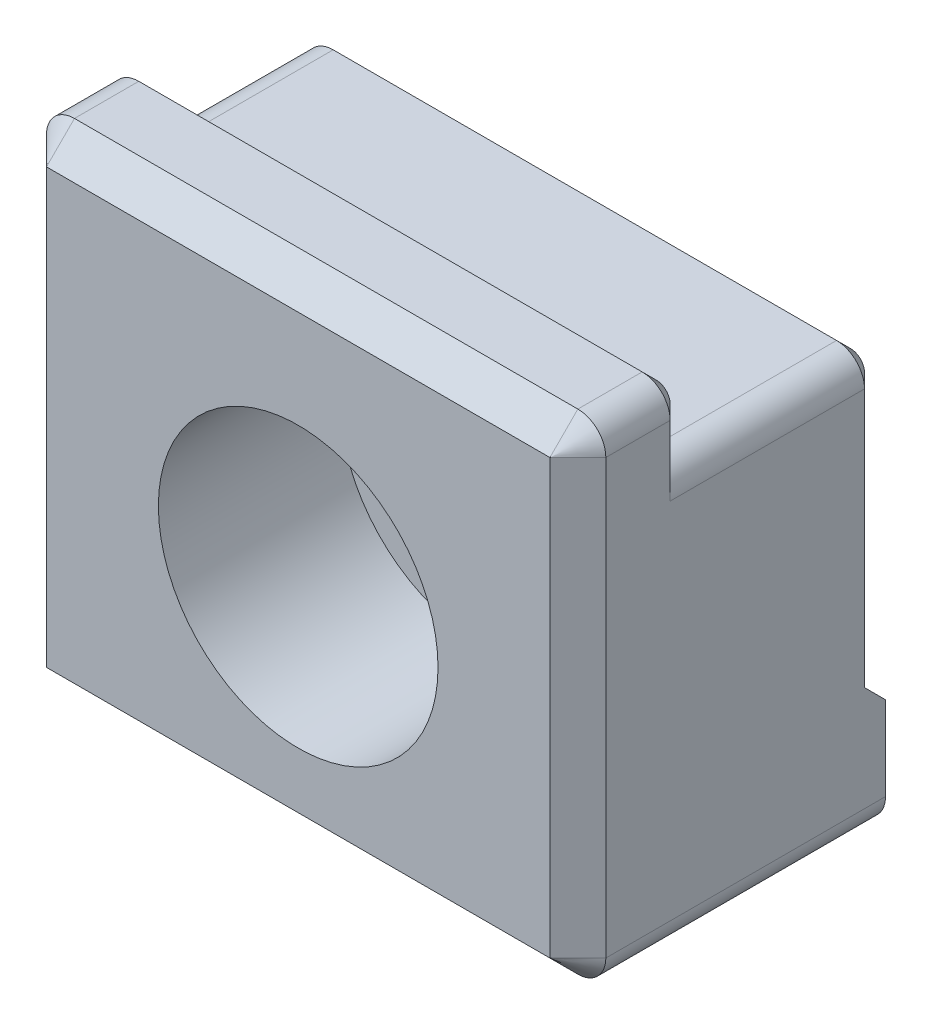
ISO-10303-21;
HEADER;
FILE_DESCRIPTION(('STEP AP214'),'2;1');
FILE_NAME('part.step','',(''),(''),'','','');
FILE_SCHEMA(('AUTOMOTIVE_DESIGN { 1 0 10303 214 1 1 1 1 }'));
ENDSEC;
DATA;
#1=APPLICATION_CONTEXT('core data for automotive mechanical design processes');
#2=APPLICATION_PROTOCOL_DEFINITION('international standard','automotive_design',2000,#1);
#3=PRODUCT_CONTEXT('',#1,'mechanical');
#4=PRODUCT('Part','Part','',(#3));
#5=PRODUCT_RELATED_PRODUCT_CATEGORY('part','',(#4));
#6=PRODUCT_DEFINITION_FORMATION('','',#4);
#7=PRODUCT_DEFINITION_CONTEXT('part definition',#1,'design');
#8=PRODUCT_DEFINITION('design','',#6,#7);
#9=PRODUCT_DEFINITION_SHAPE('','',#8);
#10=(LENGTH_UNIT() NAMED_UNIT(*) SI_UNIT(.MILLI.,.METRE.));
#11=(NAMED_UNIT(*) PLANE_ANGLE_UNIT() SI_UNIT($,.RADIAN.));
#12=(NAMED_UNIT(*) SI_UNIT($,.STERADIAN.) SOLID_ANGLE_UNIT());
#13=UNCERTAINTY_MEASURE_WITH_UNIT(LENGTH_MEASURE(1.E-05),#10,'distance_accuracy_value','');
#14=(GEOMETRIC_REPRESENTATION_CONTEXT(3) GLOBAL_UNCERTAINTY_ASSIGNED_CONTEXT((#13)) GLOBAL_UNIT_ASSIGNED_CONTEXT((#10,
#11,#12)) REPRESENTATION_CONTEXT('',''));
#15=CARTESIAN_POINT('',(0.,0.,0.));
#16=DIRECTION('',(0.,0.,1.));
#17=DIRECTION('',(1.,0.,0.));
#18=AXIS2_PLACEMENT_3D('',#15,#16,#17);
#19=CARTESIAN_POINT('',(-20.,-16.,23.));
#20=DIRECTION('',(0.,1.,0.));
#21=DIRECTION('',(0.,0.,-1.));
#22=AXIS2_PLACEMENT_3D('',#19,#20,#21);
#23=PLANE('',#22);
#24=DIRECTION('',(0.,0.,1.));
#25=VECTOR('',#24,1.);
#26=CARTESIAN_POINT('',(-18.,-16.,23.));
#27=LINE('',#26,#25);
#28=CARTESIAN_POINT('',(-18.,-16.,21.));
#29=VERTEX_POINT('',#28);
#30=CARTESIAN_POINT('',(-18.,-16.,1.));
#31=VERTEX_POINT('',#30);
#32=EDGE_CURVE('E208',#29,#31,#27,.F.);
#33=ORIENTED_EDGE('',*,*,#32,.T.);
#34=DIRECTION('',(1.,0.,0.));
#35=VECTOR('',#34,1.);
#36=CARTESIAN_POINT('',(-20.,-16.,1.));
#37=LINE('',#36,#35);
#38=CARTESIAN_POINT('',(18.,-16.,1.));
#39=VERTEX_POINT('',#38);
#40=EDGE_CURVE('E281',#31,#39,#37,.T.);
#41=ORIENTED_EDGE('',*,*,#40,.T.);
#42=DIRECTION('',(0.,0.,1.));
#43=VECTOR('',#42,1.);
#44=CARTESIAN_POINT('',(18.,-16.,23.));
#45=LINE('',#44,#43);
#46=CARTESIAN_POINT('',(18.,-16.,21.));
#47=VERTEX_POINT('',#46);
#48=EDGE_CURVE('E213',#39,#47,#45,.T.);
#49=ORIENTED_EDGE('',*,*,#48,.T.);
#50=DIRECTION('',(-1.,0.,0.));
#51=VECTOR('',#50,1.);
#52=CARTESIAN_POINT('',(-20.,-16.,21.));
#53=LINE('',#52,#51);
#54=EDGE_CURVE('E230',#47,#29,#53,.T.);
#55=ORIENTED_EDGE('',*,*,#54,.T.);
#56=EDGE_LOOP('',(#33,#41,#49,#55));
#57=FACE_BOUND('',#56,.T.);
#58=ADVANCED_FACE('F14',(#57),#23,.F.);
#59=CARTESIAN_POINT('',(-20.,19.,23.));
#60=DIRECTION('',(0.,0.,-1.));
#61=DIRECTION('',(1.,0.,0.));
#62=AXIS2_PLACEMENT_3D('',#59,#60,#61);
#63=PLANE('',#62);
#64=DIRECTION('',(0.,1.,0.));
#65=VECTOR('',#64,1.);
#66=CARTESIAN_POINT('',(18.,17.,23.));
#67=LINE('',#66,#65);
#68=CARTESIAN_POINT('',(18.,-14.,23.));
#69=VERTEX_POINT('',#68);
#70=CARTESIAN_POINT('',(18.,17.,23.));
#71=VERTEX_POINT('',#70);
#72=EDGE_CURVE('E223',#69,#71,#67,.T.);
#73=ORIENTED_EDGE('',*,*,#72,.T.);
#74=DIRECTION('',(-1.,0.,0.));
#75=VECTOR('',#74,1.);
#76=CARTESIAN_POINT('',(-20.,17.,23.));
#77=LINE('',#76,#75);
#78=CARTESIAN_POINT('',(-18.,17.,23.));
#79=VERTEX_POINT('',#78);
#80=EDGE_CURVE('E225',#71,#79,#77,.T.);
#81=ORIENTED_EDGE('',*,*,#80,.T.);
#82=DIRECTION('',(0.,-1.,0.));
#83=VECTOR('',#82,1.);
#84=CARTESIAN_POINT('',(-18.,19.,23.));
#85=LINE('',#84,#83);
#86=CARTESIAN_POINT('',(-18.,-14.,23.));
#87=VERTEX_POINT('',#86);
#88=EDGE_CURVE('E219',#79,#87,#85,.T.);
#89=ORIENTED_EDGE('',*,*,#88,.T.);
#90=DIRECTION('',(1.,0.,0.));
#91=VECTOR('',#90,1.);
#92=CARTESIAN_POINT('',(-20.,-14.,23.));
#93=LINE('',#92,#91);
#94=EDGE_CURVE('E221',#87,#69,#93,.T.);
#95=ORIENTED_EDGE('',*,*,#94,.T.);
#96=EDGE_LOOP('',(#73,#81,#89,#95));
#97=FACE_BOUND('',#96,.T.);
#98=CARTESIAN_POINT('',(0.,0.,23.));
#99=DIRECTION('',(0.,0.,1.));
#100=DIRECTION('',(-1.,0.,0.));
#101=AXIS2_PLACEMENT_3D('',#98,#99,#100);
#102=CIRCLE('',#101,10.);
#103=CARTESIAN_POINT('',(-10.,0.,23.));
#104=VERTEX_POINT('',#103);
#105=EDGE_CURVE('E403',#104,#104,#102,.T.);
#106=ORIENTED_EDGE('',*,*,#105,.F.);
#107=EDGE_LOOP('',(#106));
#108=FACE_BOUND('',#107,.T.);
#109=ADVANCED_FACE('F458',(#97,#108),#63,.F.);
#110=CARTESIAN_POINT('',(-20.,19.,15.4));
#111=DIRECTION('',(0.,-1.,0.));
#112=DIRECTION('',(0.,0.,1.));
#113=AXIS2_PLACEMENT_3D('',#110,#111,#112);
#114=PLANE('',#113);
#115=DIRECTION('',(0.,0.,-1.));
#116=VECTOR('',#115,1.);
#117=CARTESIAN_POINT('',(18.,19.,15.4));
#118=LINE('',#117,#116);
#119=CARTESIAN_POINT('',(18.,19.,21.));
#120=VERTEX_POINT('',#119);
#121=CARTESIAN_POINT('',(18.,19.,16.4));
#122=VERTEX_POINT('',#121);
#123=EDGE_CURVE('E430',#120,#122,#118,.T.);
#124=ORIENTED_EDGE('',*,*,#123,.T.);
#125=DIRECTION('',(-1.,0.,0.));
#126=VECTOR('',#125,1.);
#127=CARTESIAN_POINT('',(-20.,19.,16.4));
#128=LINE('',#127,#126);
#129=CARTESIAN_POINT('',(-18.,19.,16.4));
#130=VERTEX_POINT('',#129);
#131=EDGE_CURVE('E35',#122,#130,#128,.T.);
#132=ORIENTED_EDGE('',*,*,#131,.T.);
#133=DIRECTION('',(0.,0.,-1.));
#134=VECTOR('',#133,1.);
#135=CARTESIAN_POINT('',(-18.,19.,15.4));
#136=LINE('',#135,#134);
#137=CARTESIAN_POINT('',(-18.,19.,21.));
#138=VERTEX_POINT('',#137);
#139=EDGE_CURVE('E432',#130,#138,#136,.F.);
#140=ORIENTED_EDGE('',*,*,#139,.T.);
#141=DIRECTION('',(1.,0.,0.));
#142=VECTOR('',#141,1.);
#143=CARTESIAN_POINT('',(-20.,19.,21.));
#144=LINE('',#143,#142);
#145=EDGE_CURVE('E210',#138,#120,#144,.T.);
#146=ORIENTED_EDGE('',*,*,#145,.T.);
#147=EDGE_LOOP('',(#124,#132,#140,#146));
#148=FACE_BOUND('',#147,.T.);
#149=ADVANCED_FACE('F551',(#148),#114,.F.);
#150=CARTESIAN_POINT('',(-20.,14.,15.4));
#151=DIRECTION('',(0.,0.,1.));
#152=DIRECTION('',(-1.,0.,0.));
#153=AXIS2_PLACEMENT_3D('',#150,#151,#152);
#154=PLANE('',#153);
#155=CARTESIAN_POINT('',(18.,17.,15.4));
#156=DIRECTION('',(0.,0.,1.));
#157=DIRECTION('',(-1.,0.,0.));
#158=AXIS2_PLACEMENT_3D('',#155,#156,#157);
#159=CIRCLE('',#158,1.);
#160=CARTESIAN_POINT('',(18.,18.,15.4));
#161=VERTEX_POINT('',#160);
#162=CARTESIAN_POINT('',(19.,17.,15.4));
#163=VERTEX_POINT('',#162);
#164=EDGE_CURVE('E299',#161,#163,#159,.F.);
#165=ORIENTED_EDGE('',*,*,#164,.T.);
#166=DIRECTION('',(0.,-1.,0.));
#167=VECTOR('',#166,1.);
#168=CARTESIAN_POINT('',(19.,12.,15.4));
#169=LINE('',#168,#167);
#170=CARTESIAN_POINT('',(19.,13.7320508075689,15.4));
#171=VERTEX_POINT('',#170);
#172=EDGE_CURVE('E305',#163,#171,#169,.T.);
#173=ORIENTED_EDGE('',*,*,#172,.T.);
#174=CARTESIAN_POINT('',(18.,12.,15.4));
#175=DIRECTION('',(0.,0.,1.));
#176=DIRECTION('',(-1.,0.,0.));
#177=AXIS2_PLACEMENT_3D('',#174,#175,#176);
#178=CIRCLE('',#177,2.);
#179=CARTESIAN_POINT('',(18.,14.,15.4));
#180=VERTEX_POINT('',#179);
#181=EDGE_CURVE('E202',#171,#180,#178,.T.);
#182=ORIENTED_EDGE('',*,*,#181,.T.);
#183=DIRECTION('',(1.,0.,0.));
#184=VECTOR('',#183,1.);
#185=CARTESIAN_POINT('',(-20.,14.,15.4));
#186=LINE('',#185,#184);
#187=CARTESIAN_POINT('',(-18.,14.,15.4));
#188=VERTEX_POINT('',#187);
#189=EDGE_CURVE('E185',#188,#180,#186,.T.);
#190=ORIENTED_EDGE('',*,*,#189,.F.);
#191=CARTESIAN_POINT('',(-18.,12.,15.4));
#192=DIRECTION('',(0.,0.,1.));
#193=DIRECTION('',(-1.,0.,0.));
#194=AXIS2_PLACEMENT_3D('',#191,#192,#193);
#195=CIRCLE('',#194,2.);
#196=CARTESIAN_POINT('',(-19.,13.7320508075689,15.4));
#197=VERTEX_POINT('',#196);
#198=EDGE_CURVE('E198',#188,#197,#195,.T.);
#199=ORIENTED_EDGE('',*,*,#198,.T.);
#200=DIRECTION('',(0.,1.,0.));
#201=VECTOR('',#200,1.);
#202=CARTESIAN_POINT('',(-19.,14.,15.4));
#203=LINE('',#202,#201);
#204=CARTESIAN_POINT('',(-19.,17.,15.4));
#205=VERTEX_POINT('',#204);
#206=EDGE_CURVE('E303',#197,#205,#203,.T.);
#207=ORIENTED_EDGE('',*,*,#206,.T.);
#208=CARTESIAN_POINT('',(-18.,17.,15.4));
#209=DIRECTION('',(0.,0.,1.));
#210=DIRECTION('',(-1.,0.,0.));
#211=AXIS2_PLACEMENT_3D('',#208,#209,#210);
#212=CIRCLE('',#211,1.);
#213=CARTESIAN_POINT('',(-18.,18.,15.4));
#214=VERTEX_POINT('',#213);
#215=EDGE_CURVE('E301',#205,#214,#212,.F.);
#216=ORIENTED_EDGE('',*,*,#215,.T.);
#217=DIRECTION('',(1.,0.,0.));
#218=VECTOR('',#217,1.);
#219=CARTESIAN_POINT('',(-20.,18.,15.4));
#220=LINE('',#219,#218);
#221=EDGE_CURVE('E297',#214,#161,#220,.T.);
#222=ORIENTED_EDGE('',*,*,#221,.T.);
#223=EDGE_LOOP('',(#165,#173,#182,#190,#199,#207,#216,#222));
#224=FACE_BOUND('',#223,.T.);
#225=ADVANCED_FACE('F197',(#224),#154,.F.);
#226=CARTESIAN_POINT('',(-20.,14.,1.5));
#227=DIRECTION('',(0.,-1.,0.));
#228=DIRECTION('',(0.,0.,1.));
#229=AXIS2_PLACEMENT_3D('',#226,#227,#228);
#230=PLANE('',#229);
#231=DIRECTION('',(0.,0.,-1.));
#232=VECTOR('',#231,1.);
#233=CARTESIAN_POINT('',(18.,14.,1.5));
#234=LINE('',#233,#232);
#235=CARTESIAN_POINT('',(18.,14.,2.5));
#236=VERTEX_POINT('',#235);
#237=EDGE_CURVE('E193',#180,#236,#234,.T.);
#238=ORIENTED_EDGE('',*,*,#237,.T.);
#239=DIRECTION('',(-1.,0.,0.));
#240=VECTOR('',#239,1.);
#241=CARTESIAN_POINT('',(-20.,14.,2.5));
#242=LINE('',#241,#240);
#243=CARTESIAN_POINT('',(-18.,14.,2.5));
#244=VERTEX_POINT('',#243);
#245=EDGE_CURVE('E188',#236,#244,#242,.T.);
#246=ORIENTED_EDGE('',*,*,#245,.T.);
#247=DIRECTION('',(0.,0.,-1.));
#248=VECTOR('',#247,1.);
#249=CARTESIAN_POINT('',(-18.,14.,1.5));
#250=LINE('',#249,#248);
#251=EDGE_CURVE('E181',#244,#188,#250,.F.);
#252=ORIENTED_EDGE('',*,*,#251,.T.);
#253=ORIENTED_EDGE('',*,*,#189,.T.);
#254=EDGE_LOOP('',(#238,#246,#252,#253));
#255=FACE_BOUND('',#254,.T.);
#256=ADVANCED_FACE('F184',(#255),#230,.F.);
#257=CARTESIAN_POINT('',(-20.,-7.5,1.5));
#258=DIRECTION('',(0.,0.,1.));
#259=DIRECTION('',(-1.,0.,0.));
#260=AXIS2_PLACEMENT_3D('',#257,#258,#259);
#261=PLANE('',#260);
#262=CARTESIAN_POINT('',(0.,0.,1.5));
#263=DIRECTION('',(0.,0.,1.));
#264=DIRECTION('',(-1.,0.,0.));
#265=AXIS2_PLACEMENT_3D('',#262,#263,#264);
#266=CIRCLE('',#265,6.75);
#267=CARTESIAN_POINT('',(-6.75,0.,1.5));
#268=VERTEX_POINT('',#267);
#269=EDGE_CURVE('E406',#268,#268,#266,.T.);
#270=ORIENTED_EDGE('',*,*,#269,.T.);
#271=EDGE_LOOP('',(#270));
#272=FACE_BOUND('',#271,.T.);
#273=CARTESIAN_POINT('',(18.,12.,1.5));
#274=DIRECTION('',(0.,0.,1.));
#275=DIRECTION('',(-1.,0.,0.));
#276=AXIS2_PLACEMENT_3D('',#273,#274,#275);
#277=CIRCLE('',#276,1.);
#278=CARTESIAN_POINT('',(18.,13.,1.5));
#279=VERTEX_POINT('',#278);
#280=CARTESIAN_POINT('',(19.,12.,1.5));
#281=VERTEX_POINT('',#280);
#282=EDGE_CURVE('E253',#279,#281,#277,.F.);
#283=ORIENTED_EDGE('',*,*,#282,.T.);
#284=DIRECTION('',(0.,-1.,0.));
#285=VECTOR('',#284,1.);
#286=CARTESIAN_POINT('',(19.,-7.5,1.5));
#287=LINE('',#286,#285);
#288=CARTESIAN_POINT('',(19.,-7.5,1.5));
#289=VERTEX_POINT('',#288);
#290=EDGE_CURVE('E255',#281,#289,#287,.T.);
#291=ORIENTED_EDGE('',*,*,#290,.T.);
#292=DIRECTION('',(1.,0.,0.));
#293=VECTOR('',#292,1.);
#294=CARTESIAN_POINT('',(-20.,-7.5,1.5));
#295=LINE('',#294,#293);
#296=CARTESIAN_POINT('',(-19.,-7.5,1.5));
#297=VERTEX_POINT('',#296);
#298=EDGE_CURVE('E204',#297,#289,#295,.T.);
#299=ORIENTED_EDGE('',*,*,#298,.F.);
#300=DIRECTION('',(0.,1.,0.));
#301=VECTOR('',#300,1.);
#302=CARTESIAN_POINT('',(-19.,-7.5,1.5));
#303=LINE('',#302,#301);
#304=CARTESIAN_POINT('',(-19.,12.,1.5));
#305=VERTEX_POINT('',#304);
#306=EDGE_CURVE('E246',#297,#305,#303,.T.);
#307=ORIENTED_EDGE('',*,*,#306,.T.);
#308=CARTESIAN_POINT('',(-18.,12.,1.5));
#309=DIRECTION('',(0.,0.,1.));
#310=DIRECTION('',(-1.,0.,0.));
#311=AXIS2_PLACEMENT_3D('',#308,#309,#310);
#312=CIRCLE('',#311,1.);
#313=CARTESIAN_POINT('',(-18.,13.,1.5));
#314=VERTEX_POINT('',#313);
#315=EDGE_CURVE('E248',#305,#314,#312,.F.);
#316=ORIENTED_EDGE('',*,*,#315,.T.);
#317=DIRECTION('',(1.,0.,0.));
#318=VECTOR('',#317,1.);
#319=CARTESIAN_POINT('',(-20.,13.,1.5));
#320=LINE('',#319,#318);
#321=EDGE_CURVE('E250',#314,#279,#320,.T.);
#322=ORIENTED_EDGE('',*,*,#321,.T.);
#323=EDGE_LOOP('',(#283,#291,#299,#307,#316,#322));
#324=FACE_BOUND('',#323,.T.);
#325=ADVANCED_FACE('F498',(#272,#324),#261,.F.);
#326=CARTESIAN_POINT('',(-20.,-9.,0.));
#327=DIRECTION('',(0.,-0.707106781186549,0.707106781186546));
#328=DIRECTION('',(0.,0.707106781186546,0.707106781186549));
#329=AXIS2_PLACEMENT_3D('',#326,#327,#328);
#330=PLANE('',#329);
#331=DIRECTION('',(1.,0.,0.));
#332=VECTOR('',#331,1.);
#333=CARTESIAN_POINT('',(-20.,-9.,0.));
#334=LINE('',#333,#332);
#335=CARTESIAN_POINT('',(-19.,-9.,0.));
#336=VERTEX_POINT('',#335);
#337=CARTESIAN_POINT('',(19.,-9.,0.));
#338=VERTEX_POINT('',#337);
#339=EDGE_CURVE('E413',#336,#338,#334,.T.);
#340=ORIENTED_EDGE('',*,*,#339,.F.);
#341=DIRECTION('',(0.577350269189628,-0.577350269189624,-0.577350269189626));
#342=VECTOR('',#341,1.);
#343=CARTESIAN_POINT('',(-17.3333333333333,-10.6666666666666,-1.66666666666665));
#344=LINE('',#343,#342);
#345=CARTESIAN_POINT('',(-20.,-8.,1.));
#346=VERTEX_POINT('',#345);
#347=EDGE_CURVE('E279',#336,#346,#344,.F.);
#348=ORIENTED_EDGE('',*,*,#347,.T.);
#349=DIRECTION('',(0.,-0.707106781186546,-0.707106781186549));
#350=VECTOR('',#349,1.);
#351=CARTESIAN_POINT('',(-20.,-9.,0.));
#352=LINE('',#351,#350);
#353=CARTESIAN_POINT('',(-20.,-6.5,2.5));
#354=VERTEX_POINT('',#353);
#355=EDGE_CURVE('E410',#354,#346,#352,.T.);
#356=ORIENTED_EDGE('',*,*,#355,.F.);
#357=DIRECTION('',(-0.577350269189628,0.577350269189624,0.577350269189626));
#358=VECTOR('',#357,1.);
#359=CARTESIAN_POINT('',(-18.3333333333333,-8.16666666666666,0.833333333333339));
#360=LINE('',#359,#358);
#361=EDGE_CURVE('E314',#354,#297,#360,.F.);
#362=ORIENTED_EDGE('',*,*,#361,.T.);
#363=ORIENTED_EDGE('',*,*,#298,.T.);
#364=DIRECTION('',(0.577350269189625,0.577350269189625,0.577350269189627));
#365=VECTOR('',#364,1.);
#366=CARTESIAN_POINT('',(5.,-21.5,-12.5));
#367=LINE('',#366,#365);
#368=CARTESIAN_POINT('',(20.,-6.5,2.5));
#369=VERTEX_POINT('',#368);
#370=EDGE_CURVE('E311',#289,#369,#367,.T.);
#371=ORIENTED_EDGE('',*,*,#370,.T.);
#372=DIRECTION('',(0.,-0.707106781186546,-0.707106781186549));
#373=VECTOR('',#372,1.);
#374=CARTESIAN_POINT('',(20.,-9.,0.));
#375=LINE('',#374,#373);
#376=CARTESIAN_POINT('',(20.,-8.,1.));
#377=VERTEX_POINT('',#376);
#378=EDGE_CURVE('E407',#369,#377,#375,.T.);
#379=ORIENTED_EDGE('',*,*,#378,.T.);
#380=DIRECTION('',(-0.577350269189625,-0.577350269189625,-0.577350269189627));
#381=VECTOR('',#380,1.);
#382=CARTESIAN_POINT('',(16.6666666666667,-11.3333333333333,-2.33333333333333));
#383=LINE('',#382,#381);
#384=EDGE_CURVE('E277',#377,#338,#383,.T.);
#385=ORIENTED_EDGE('',*,*,#384,.T.);
#386=EDGE_LOOP('',(#340,#348,#356,#362,#363,#371,#379,#385));
#387=FACE_BOUND('',#386,.T.);
#388=ADVANCED_FACE('F504',(#387),#330,.F.);
#389=CARTESIAN_POINT('',(-20.,-16.,0.));
#390=DIRECTION('',(0.,0.,1.));
#391=DIRECTION('',(-1.,0.,0.));
#392=AXIS2_PLACEMENT_3D('',#389,#390,#391);
#393=PLANE('',#392);
#394=CARTESIAN_POINT('',(-18.,-14.,0.));
#395=DIRECTION('',(0.,0.,1.));
#396=DIRECTION('',(-1.,0.,0.));
#397=AXIS2_PLACEMENT_3D('',#394,#395,#396);
#398=CIRCLE('',#397,1.);
#399=CARTESIAN_POINT('',(-18.,-15.,0.));
#400=VERTEX_POINT('',#399);
#401=CARTESIAN_POINT('',(-19.,-14.,0.));
#402=VERTEX_POINT('',#401);
#403=EDGE_CURVE('E273',#400,#402,#398,.F.);
#404=ORIENTED_EDGE('',*,*,#403,.T.);
#405=DIRECTION('',(0.,1.,0.));
#406=VECTOR('',#405,1.);
#407=CARTESIAN_POINT('',(-19.,-16.,0.));
#408=LINE('',#407,#406);
#409=EDGE_CURVE('E275',#402,#336,#408,.T.);
#410=ORIENTED_EDGE('',*,*,#409,.T.);
#411=ORIENTED_EDGE('',*,*,#339,.T.);
#412=DIRECTION('',(0.,-1.,0.));
#413=VECTOR('',#412,1.);
#414=CARTESIAN_POINT('',(19.,-14.,0.));
#415=LINE('',#414,#413);
#416=CARTESIAN_POINT('',(19.,-14.,0.));
#417=VERTEX_POINT('',#416);
#418=EDGE_CURVE('E267',#338,#417,#415,.T.);
#419=ORIENTED_EDGE('',*,*,#418,.T.);
#420=CARTESIAN_POINT('',(18.,-14.,0.));
#421=DIRECTION('',(0.,0.,1.));
#422=DIRECTION('',(-1.,0.,0.));
#423=AXIS2_PLACEMENT_3D('',#420,#421,#422);
#424=CIRCLE('',#423,1.);
#425=CARTESIAN_POINT('',(18.,-15.,0.));
#426=VERTEX_POINT('',#425);
#427=EDGE_CURVE('E269',#417,#426,#424,.F.);
#428=ORIENTED_EDGE('',*,*,#427,.T.);
#429=DIRECTION('',(-1.,0.,0.));
#430=VECTOR('',#429,1.);
#431=CARTESIAN_POINT('',(-20.,-15.,0.));
#432=LINE('',#431,#430);
#433=EDGE_CURVE('E271',#426,#400,#432,.T.);
#434=ORIENTED_EDGE('',*,*,#433,.T.);
#435=EDGE_LOOP('',(#404,#410,#411,#419,#428,#434));
#436=FACE_BOUND('',#435,.T.);
#437=ADVANCED_FACE('F517',(#436),#393,.F.);
#438=CARTESIAN_POINT('',(-20.,-16.,0.));
#439=DIRECTION('',(1.,0.,0.));
#440=DIRECTION('',(0.,1.,0.));
#441=AXIS2_PLACEMENT_3D('',#438,#439,#440);
#442=PLANE('',#441);
#443=ORIENTED_EDGE('',*,*,#355,.T.);
#444=DIRECTION('',(0.,-1.,0.));
#445=VECTOR('',#444,1.);
#446=CARTESIAN_POINT('',(-20.,-16.,1.));
#447=LINE('',#446,#445);
#448=CARTESIAN_POINT('',(-20.,-14.,1.));
#449=VERTEX_POINT('',#448);
#450=EDGE_CURVE('E264',#346,#449,#447,.T.);
#451=ORIENTED_EDGE('',*,*,#450,.T.);
#452=DIRECTION('',(0.,0.,1.));
#453=VECTOR('',#452,1.);
#454=CARTESIAN_POINT('',(-20.,-14.,0.));
#455=LINE('',#454,#453);
#456=CARTESIAN_POINT('',(-20.,-14.,21.));
#457=VERTEX_POINT('',#456);
#458=EDGE_CURVE('E203',#449,#457,#455,.T.);
#459=ORIENTED_EDGE('',*,*,#458,.T.);
#460=DIRECTION('',(0.,1.,0.));
#461=VECTOR('',#460,1.);
#462=CARTESIAN_POINT('',(-20.,-16.,21.));
#463=LINE('',#462,#461);
#464=CARTESIAN_POINT('',(-20.,17.,21.));
#465=VERTEX_POINT('',#464);
#466=EDGE_CURVE('E244',#457,#465,#463,.T.);
#467=ORIENTED_EDGE('',*,*,#466,.T.);
#468=DIRECTION('',(0.,0.,-1.));
#469=VECTOR('',#468,1.);
#470=CARTESIAN_POINT('',(-20.,17.,0.));
#471=LINE('',#470,#469);
#472=CARTESIAN_POINT('',(-20.,17.,16.4));
#473=VERTEX_POINT('',#472);
#474=EDGE_CURVE('E421',#465,#473,#471,.T.);
#475=ORIENTED_EDGE('',*,*,#474,.T.);
#476=DIRECTION('',(0.,-1.,0.));
#477=VECTOR('',#476,1.);
#478=CARTESIAN_POINT('',(-20.,-16.,16.4));
#479=LINE('',#478,#477);
#480=CARTESIAN_POINT('',(-20.,12.,16.4));
#481=VERTEX_POINT('',#480);
#482=EDGE_CURVE('E258',#473,#481,#479,.T.);
#483=ORIENTED_EDGE('',*,*,#482,.T.);
#484=DIRECTION('',(0.,0.,-1.));
#485=VECTOR('',#484,1.);
#486=CARTESIAN_POINT('',(-20.,12.,0.));
#487=LINE('',#486,#485);
#488=CARTESIAN_POINT('',(-20.,12.,2.5));
#489=VERTEX_POINT('',#488);
#490=EDGE_CURVE('E424',#481,#489,#487,.T.);
#491=ORIENTED_EDGE('',*,*,#490,.T.);
#492=DIRECTION('',(0.,-1.,0.));
#493=VECTOR('',#492,1.);
#494=CARTESIAN_POINT('',(-20.,-16.,2.5));
#495=LINE('',#494,#493);
#496=EDGE_CURVE('E261',#489,#354,#495,.T.);
#497=ORIENTED_EDGE('',*,*,#496,.T.);
#498=EDGE_LOOP('',(#443,#451,#459,#467,#475,#483,#491,#497));
#499=FACE_BOUND('',#498,.T.);
#500=ADVANCED_FACE('F471',(#499),#442,.F.);
#501=CARTESIAN_POINT('',(20.,-16.,0.));
#502=DIRECTION('',(1.,0.,0.));
#503=DIRECTION('',(0.,1.,0.));
#504=AXIS2_PLACEMENT_3D('',#501,#502,#503);
#505=PLANE('',#504);
#506=DIRECTION('',(0.,0.,1.));
#507=VECTOR('',#506,1.);
#508=CARTESIAN_POINT('',(20.,-14.,0.));
#509=LINE('',#508,#507);
#510=CARTESIAN_POINT('',(20.,-14.,21.));
#511=VERTEX_POINT('',#510);
#512=CARTESIAN_POINT('',(20.,-14.,1.));
#513=VERTEX_POINT('',#512);
#514=EDGE_CURVE('E334',#511,#513,#509,.F.);
#515=ORIENTED_EDGE('',*,*,#514,.T.);
#516=DIRECTION('',(0.,1.,0.));
#517=VECTOR('',#516,1.);
#518=CARTESIAN_POINT('',(20.,-9.,1.));
#519=LINE('',#518,#517);
#520=EDGE_CURVE('E291',#513,#377,#519,.T.);
#521=ORIENTED_EDGE('',*,*,#520,.T.);
#522=ORIENTED_EDGE('',*,*,#378,.F.);
#523=DIRECTION('',(0.,1.,0.));
#524=VECTOR('',#523,1.);
#525=CARTESIAN_POINT('',(20.,12.,2.5));
#526=LINE('',#525,#524);
#527=CARTESIAN_POINT('',(20.,12.,2.5));
#528=VERTEX_POINT('',#527);
#529=EDGE_CURVE('E289',#369,#528,#526,.T.);
#530=ORIENTED_EDGE('',*,*,#529,.T.);
#531=DIRECTION('',(0.,0.,-1.));
#532=VECTOR('',#531,1.);
#533=CARTESIAN_POINT('',(20.,12.,15.4));
#534=LINE('',#533,#532);
#535=CARTESIAN_POINT('',(20.,12.,16.4));
#536=VERTEX_POINT('',#535);
#537=EDGE_CURVE('E320',#528,#536,#534,.F.);
#538=ORIENTED_EDGE('',*,*,#537,.T.);
#539=DIRECTION('',(0.,1.,0.));
#540=VECTOR('',#539,1.);
#541=CARTESIAN_POINT('',(20.,17.,16.4));
#542=LINE('',#541,#540);
#543=CARTESIAN_POINT('',(20.,17.,16.4));
#544=VERTEX_POINT('',#543);
#545=EDGE_CURVE('E287',#536,#544,#542,.T.);
#546=ORIENTED_EDGE('',*,*,#545,.T.);
#547=DIRECTION('',(0.,0.,-1.));
#548=VECTOR('',#547,1.);
#549=CARTESIAN_POINT('',(20.,17.,23.));
#550=LINE('',#549,#548);
#551=CARTESIAN_POINT('',(20.,17.,21.));
#552=VERTEX_POINT('',#551);
#553=EDGE_CURVE('E192',#544,#552,#550,.F.);
#554=ORIENTED_EDGE('',*,*,#553,.T.);
#555=DIRECTION('',(0.,-1.,0.));
#556=VECTOR('',#555,1.);
#557=CARTESIAN_POINT('',(20.,-14.,21.));
#558=LINE('',#557,#556);
#559=EDGE_CURVE('E228',#552,#511,#558,.T.);
#560=ORIENTED_EDGE('',*,*,#559,.T.);
#561=EDGE_LOOP('',(#515,#521,#522,#530,#538,#546,#554,#560));
#562=FACE_BOUND('',#561,.T.);
#563=ADVANCED_FACE('F330',(#562),#505,.T.);
#564=CARTESIAN_POINT('',(0.,0.,23.));
#565=DIRECTION('',(0.,0.,1.));
#566=DIRECTION('',(-1.,0.,0.));
#567=AXIS2_PLACEMENT_3D('',#564,#565,#566);
#568=CYLINDRICAL_SURFACE('',#567,6.75);
#569=CARTESIAN_POINT('',(0.,0.,10.));
#570=DIRECTION('',(0.,0.,1.));
#571=DIRECTION('',(-1.,0.,0.));
#572=AXIS2_PLACEMENT_3D('',#569,#570,#571);
#573=CIRCLE('',#572,6.75);
#574=CARTESIAN_POINT('',(-6.75,0.,10.));
#575=VERTEX_POINT('',#574);
#576=EDGE_CURVE('E397',#575,#575,#573,.T.);
#577=ORIENTED_EDGE('',*,*,#576,.T.);
#578=EDGE_LOOP('',(#577));
#579=FACE_BOUND('',#578,.T.);
#580=ORIENTED_EDGE('',*,*,#269,.F.);
#581=EDGE_LOOP('',(#580));
#582=FACE_BOUND('',#581,.T.);
#583=ADVANCED_FACE('F573',(#579,#582),#568,.F.);
#584=CARTESIAN_POINT('',(0.,0.,23.));
#585=DIRECTION('',(0.,0.,1.));
#586=DIRECTION('',(-1.,0.,0.));
#587=AXIS2_PLACEMENT_3D('',#584,#585,#586);
#588=CYLINDRICAL_SURFACE('',#587,10.);
#589=CARTESIAN_POINT('',(0.,0.,10.));
#590=DIRECTION('',(0.,0.,1.));
#591=DIRECTION('',(-1.,0.,0.));
#592=AXIS2_PLACEMENT_3D('',#589,#590,#591);
#593=CIRCLE('',#592,10.);
#594=CARTESIAN_POINT('',(-10.,0.,10.));
#595=VERTEX_POINT('',#594);
#596=EDGE_CURVE('E400',#595,#595,#593,.T.);
#597=ORIENTED_EDGE('',*,*,#596,.F.);
#598=EDGE_LOOP('',(#597));
#599=FACE_BOUND('',#598,.T.);
#600=ORIENTED_EDGE('',*,*,#105,.T.);
#601=EDGE_LOOP('',(#600));
#602=FACE_BOUND('',#601,.T.);
#603=ADVANCED_FACE('F574',(#599,#602),#588,.F.);
#604=CARTESIAN_POINT('',(0.,-6.75,10.));
#605=DIRECTION('',(0.,0.,-1.));
#606=DIRECTION('',(1.,0.,0.));
#607=AXIS2_PLACEMENT_3D('',#604,#605,#606);
#608=PLANE('',#607);
#609=ORIENTED_EDGE('',*,*,#576,.F.);
#610=EDGE_LOOP('',(#609));
#611=FACE_BOUND('',#610,.T.);
#612=ORIENTED_EDGE('',*,*,#596,.T.);
#613=EDGE_LOOP('',(#612));
#614=FACE_BOUND('',#613,.T.);
#615=ADVANCED_FACE('F577',(#611,#614),#608,.F.);
#616=CARTESIAN_POINT('',(-18.,12.,0.));
#617=DIRECTION('',(0.,0.,-1.));
#618=DIRECTION('',(0.,-1.,0.));
#619=AXIS2_PLACEMENT_3D('',#616,#617,#618);
#620=CYLINDRICAL_SURFACE('',#619,2.);
#621=ORIENTED_EDGE('',*,*,#251,.F.);
#622=CARTESIAN_POINT('',(-18.,12.,2.5));
#623=DIRECTION('',(0.,0.,1.));
#624=DIRECTION('',(-1.,0.,0.));
#625=AXIS2_PLACEMENT_3D('',#622,#623,#624);
#626=CIRCLE('',#625,2.);
#627=EDGE_CURVE('E295',#244,#489,#626,.T.);
#628=ORIENTED_EDGE('',*,*,#627,.T.);
#629=ORIENTED_EDGE('',*,*,#490,.F.);
#630=CARTESIAN_POINT('',(-18.,12.,14.4));
#631=DIRECTION('',(0.707106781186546,0.,0.707106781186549));
#632=DIRECTION('',(0.707106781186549,0.,-0.707106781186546));
#633=AXIS2_PLACEMENT_3D('',#630,#631,#632);
#634=ELLIPSE('',#633,2.82842712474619,2.);
#635=EDGE_CURVE('E9',#481,#197,#634,.F.);
#636=ORIENTED_EDGE('',*,*,#635,.T.);
#637=ORIENTED_EDGE('',*,*,#198,.F.);
#638=EDGE_LOOP('',(#621,#628,#629,#636,#637));
#639=FACE_BOUND('',#638,.T.);
#640=ADVANCED_FACE('F206',(#639),#620,.T.);
#641=CARTESIAN_POINT('',(18.,12.,1.5));
#642=DIRECTION('',(0.,0.,1.));
#643=DIRECTION('',(0.,1.,0.));
#644=AXIS2_PLACEMENT_3D('',#641,#642,#643);
#645=CYLINDRICAL_SURFACE('',#644,2.);
#646=ORIENTED_EDGE('',*,*,#537,.F.);
#647=CARTESIAN_POINT('',(18.,12.,2.5));
#648=DIRECTION('',(0.,0.,1.));
#649=DIRECTION('',(-1.,0.,0.));
#650=AXIS2_PLACEMENT_3D('',#647,#648,#649);
#651=CIRCLE('',#650,2.);
#652=EDGE_CURVE('E293',#528,#236,#651,.T.);
#653=ORIENTED_EDGE('',*,*,#652,.T.);
#654=ORIENTED_EDGE('',*,*,#237,.F.);
#655=ORIENTED_EDGE('',*,*,#181,.F.);
#656=CARTESIAN_POINT('',(18.,12.,14.4));
#657=DIRECTION('',(0.707106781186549,0.,-0.707106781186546));
#658=DIRECTION('',(0.707106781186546,0.,0.707106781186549));
#659=AXIS2_PLACEMENT_3D('',#656,#657,#658);
#660=ELLIPSE('',#659,2.8284271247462,2.);
#661=EDGE_CURVE('E21',#171,#536,#660,.T.);
#662=ORIENTED_EDGE('',*,*,#661,.T.);
#663=EDGE_LOOP('',(#646,#653,#654,#655,#662));
#664=FACE_BOUND('',#663,.T.);
#665=ADVANCED_FACE('F319',(#664),#645,.T.);
#666=CARTESIAN_POINT('',(-18.,17.,0.));
#667=DIRECTION('',(0.,0.,-1.));
#668=DIRECTION('',(0.,-1.,0.));
#669=AXIS2_PLACEMENT_3D('',#666,#667,#668);
#670=CYLINDRICAL_SURFACE('',#669,2.);
#671=ORIENTED_EDGE('',*,*,#139,.F.);
#672=CARTESIAN_POINT('',(-18.,17.,16.4));
#673=DIRECTION('',(0.,0.,1.));
#674=DIRECTION('',(-1.,0.,0.));
#675=AXIS2_PLACEMENT_3D('',#672,#673,#674);
#676=CIRCLE('',#675,2.);
#677=EDGE_CURVE('E307',#130,#473,#676,.T.);
#678=ORIENTED_EDGE('',*,*,#677,.T.);
#679=ORIENTED_EDGE('',*,*,#474,.F.);
#680=CARTESIAN_POINT('',(-18.,17.,21.));
#681=DIRECTION('',(0.,0.,-1.));
#682=DIRECTION('',(1.,0.,0.));
#683=AXIS2_PLACEMENT_3D('',#680,#681,#682);
#684=CIRCLE('',#683,2.);
#685=EDGE_CURVE('E241',#465,#138,#684,.T.);
#686=ORIENTED_EDGE('',*,*,#685,.T.);
#687=EDGE_LOOP('',(#671,#678,#679,#686));
#688=FACE_BOUND('',#687,.T.);
#689=ADVANCED_FACE('F475',(#688),#670,.T.);
#690=CARTESIAN_POINT('',(-18.,-14.,0.));
#691=DIRECTION('',(0.,0.,1.));
#692=DIRECTION('',(0.,1.,0.));
#693=AXIS2_PLACEMENT_3D('',#690,#691,#692);
#694=CYLINDRICAL_SURFACE('',#693,2.);
#695=ORIENTED_EDGE('',*,*,#458,.F.);
#696=CARTESIAN_POINT('',(-18.,-14.,1.));
#697=DIRECTION('',(0.,0.,1.));
#698=DIRECTION('',(-1.,0.,0.));
#699=AXIS2_PLACEMENT_3D('',#696,#697,#698);
#700=CIRCLE('',#699,2.);
#701=EDGE_CURVE('E283',#449,#31,#700,.T.);
#702=ORIENTED_EDGE('',*,*,#701,.T.);
#703=ORIENTED_EDGE('',*,*,#32,.F.);
#704=CARTESIAN_POINT('',(-18.,-14.,21.));
#705=DIRECTION('',(0.,0.,-1.));
#706=DIRECTION('',(1.,0.,0.));
#707=AXIS2_PLACEMENT_3D('',#704,#705,#706);
#708=CIRCLE('',#707,2.);
#709=EDGE_CURVE('E238',#29,#457,#708,.T.);
#710=ORIENTED_EDGE('',*,*,#709,.T.);
#711=EDGE_LOOP('',(#695,#702,#703,#710));
#712=FACE_BOUND('',#711,.T.);
#713=ADVANCED_FACE('F527',(#712),#694,.T.);
#714=CARTESIAN_POINT('',(18.,-14.,23.));
#715=DIRECTION('',(0.,0.,-1.));
#716=DIRECTION('',(0.,-1.,0.));
#717=AXIS2_PLACEMENT_3D('',#714,#715,#716);
#718=CYLINDRICAL_SURFACE('',#717,2.);
#719=ORIENTED_EDGE('',*,*,#48,.F.);
#720=CARTESIAN_POINT('',(18.,-14.,1.));
#721=DIRECTION('',(0.,0.,1.));
#722=DIRECTION('',(-1.,0.,0.));
#723=AXIS2_PLACEMENT_3D('',#720,#721,#722);
#724=CIRCLE('',#723,2.);
#725=EDGE_CURVE('E285',#39,#513,#724,.T.);
#726=ORIENTED_EDGE('',*,*,#725,.T.);
#727=ORIENTED_EDGE('',*,*,#514,.F.);
#728=CARTESIAN_POINT('',(18.,-14.,21.));
#729=DIRECTION('',(0.,0.,-1.));
#730=DIRECTION('',(1.,0.,0.));
#731=AXIS2_PLACEMENT_3D('',#728,#729,#730);
#732=CIRCLE('',#731,2.);
#733=EDGE_CURVE('E232',#511,#47,#732,.T.);
#734=ORIENTED_EDGE('',*,*,#733,.T.);
#735=EDGE_LOOP('',(#719,#726,#727,#734));
#736=FACE_BOUND('',#735,.T.);
#737=ADVANCED_FACE('F442',(#736),#718,.T.);
#738=CARTESIAN_POINT('',(18.,17.,15.4));
#739=DIRECTION('',(0.,0.,1.));
#740=DIRECTION('',(0.,1.,0.));
#741=AXIS2_PLACEMENT_3D('',#738,#739,#740);
#742=CYLINDRICAL_SURFACE('',#741,2.);
#743=ORIENTED_EDGE('',*,*,#553,.F.);
#744=CARTESIAN_POINT('',(18.,17.,16.4));
#745=DIRECTION('',(0.,0.,1.));
#746=DIRECTION('',(-1.,0.,0.));
#747=AXIS2_PLACEMENT_3D('',#744,#745,#746);
#748=CIRCLE('',#747,2.);
#749=EDGE_CURVE('E28',#544,#122,#748,.T.);
#750=ORIENTED_EDGE('',*,*,#749,.T.);
#751=ORIENTED_EDGE('',*,*,#123,.F.);
#752=CARTESIAN_POINT('',(18.,17.,21.));
#753=DIRECTION('',(0.,0.,-1.));
#754=DIRECTION('',(1.,0.,0.));
#755=AXIS2_PLACEMENT_3D('',#752,#753,#754);
#756=CIRCLE('',#755,2.);
#757=EDGE_CURVE('E235',#120,#552,#756,.T.);
#758=ORIENTED_EDGE('',*,*,#757,.T.);
#759=EDGE_LOOP('',(#743,#750,#751,#758));
#760=FACE_BOUND('',#759,.T.);
#761=ADVANCED_FACE('F331',(#760),#742,.T.);
#762=CARTESIAN_POINT('',(-20.,-14.,23.));
#763=DIRECTION('',(0.,0.707106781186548,-0.707106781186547));
#764=DIRECTION('',(0.,-0.707106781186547,-0.707106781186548));
#765=AXIS2_PLACEMENT_3D('',#762,#763,#764);
#766=PLANE('',#765);
#767=DIRECTION('',(0.,0.707106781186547,0.707106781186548));
#768=VECTOR('',#767,1.);
#769=CARTESIAN_POINT('',(-18.,-16.,21.));
#770=LINE('',#769,#768);
#771=EDGE_CURVE('E394',#29,#87,#770,.T.);
#772=ORIENTED_EDGE('',*,*,#771,.F.);
#773=ORIENTED_EDGE('',*,*,#54,.F.);
#774=DIRECTION('',(0.,-0.707106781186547,-0.707106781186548));
#775=VECTOR('',#774,1.);
#776=CARTESIAN_POINT('',(18.,-14.,23.));
#777=LINE('',#776,#775);
#778=EDGE_CURVE('E391',#69,#47,#777,.T.);
#779=ORIENTED_EDGE('',*,*,#778,.F.);
#780=ORIENTED_EDGE('',*,*,#94,.F.);
#781=EDGE_LOOP('',(#772,#773,#779,#780));
#782=FACE_BOUND('',#781,.T.);
#783=ADVANCED_FACE('F448',(#782),#766,.F.);
#784=CARTESIAN_POINT('',(-18.,-14.,21.));
#785=DIRECTION('',(0.,0.,-1.));
#786=DIRECTION('',(1.,0.,0.));
#787=AXIS2_PLACEMENT_3D('',#784,#785,#786);
#788=CONICAL_SURFACE('',#787,2.,0.78539816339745);
#789=ORIENTED_EDGE('',*,*,#709,.F.);
#790=ORIENTED_EDGE('',*,*,#771,.T.);
#791=DIRECTION('',(0.707106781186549,0.,0.707106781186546));
#792=VECTOR('',#791,1.);
#793=CARTESIAN_POINT('',(-20.,-14.,21.));
#794=LINE('',#793,#792);
#795=EDGE_CURVE('E388',#457,#87,#794,.T.);
#796=ORIENTED_EDGE('',*,*,#795,.F.);
#797=EDGE_LOOP('',(#789,#790,#796));
#798=FACE_BOUND('',#797,.T.);
#799=ADVANCED_FACE('F463',(#798),#788,.T.);
#800=CARTESIAN_POINT('',(18.,-14.,21.));
#801=DIRECTION('',(0.,0.,-1.));
#802=DIRECTION('',(1.,0.,0.));
#803=AXIS2_PLACEMENT_3D('',#800,#801,#802);
#804=CONICAL_SURFACE('',#803,2.,0.78539816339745);
#805=ORIENTED_EDGE('',*,*,#778,.T.);
#806=ORIENTED_EDGE('',*,*,#733,.F.);
#807=DIRECTION('',(0.707106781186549,0.,-0.707106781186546));
#808=VECTOR('',#807,1.);
#809=CARTESIAN_POINT('',(18.,-14.,23.));
#810=LINE('',#809,#808);
#811=EDGE_CURVE('E385',#69,#511,#810,.T.);
#812=ORIENTED_EDGE('',*,*,#811,.F.);
#813=EDGE_LOOP('',(#805,#806,#812));
#814=FACE_BOUND('',#813,.T.);
#815=ADVANCED_FACE('F451',(#814),#804,.T.);
#816=CARTESIAN_POINT('',(-20.,-16.,21.));
#817=DIRECTION('',(0.707106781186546,0.,-0.707106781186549));
#818=DIRECTION('',(0.707106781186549,0.,0.707106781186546));
#819=AXIS2_PLACEMENT_3D('',#816,#817,#818);
#820=PLANE('',#819);
#821=ORIENTED_EDGE('',*,*,#795,.T.);
#822=ORIENTED_EDGE('',*,*,#88,.F.);
#823=DIRECTION('',(0.707106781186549,0.,0.707106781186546));
#824=VECTOR('',#823,1.);
#825=CARTESIAN_POINT('',(-20.,17.,21.));
#826=LINE('',#825,#824);
#827=EDGE_CURVE('E382',#465,#79,#826,.T.);
#828=ORIENTED_EDGE('',*,*,#827,.F.);
#829=ORIENTED_EDGE('',*,*,#466,.F.);
#830=EDGE_LOOP('',(#821,#822,#828,#829));
#831=FACE_BOUND('',#830,.T.);
#832=ADVANCED_FACE('F466',(#831),#820,.F.);
#833=CARTESIAN_POINT('',(18.,19.,23.));
#834=DIRECTION('',(0.707106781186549,0.,0.707106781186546));
#835=DIRECTION('',(-0.707106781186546,0.,0.707106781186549));
#836=AXIS2_PLACEMENT_3D('',#833,#834,#835);
#837=PLANE('',#836);
#838=ORIENTED_EDGE('',*,*,#811,.T.);
#839=ORIENTED_EDGE('',*,*,#559,.F.);
#840=DIRECTION('',(0.707106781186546,0.,-0.707106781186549));
#841=VECTOR('',#840,1.);
#842=CARTESIAN_POINT('',(18.,17.,23.));
#843=LINE('',#842,#841);
#844=EDGE_CURVE('E379',#71,#552,#843,.T.);
#845=ORIENTED_EDGE('',*,*,#844,.F.);
#846=ORIENTED_EDGE('',*,*,#72,.F.);
#847=EDGE_LOOP('',(#838,#839,#845,#846));
#848=FACE_BOUND('',#847,.T.);
#849=ADVANCED_FACE('F455',(#848),#837,.T.);
#850=CARTESIAN_POINT('',(-18.,17.,21.));
#851=DIRECTION('',(0.,0.,-1.));
#852=DIRECTION('',(1.,0.,0.));
#853=AXIS2_PLACEMENT_3D('',#850,#851,#852);
#854=CONICAL_SURFACE('',#853,2.,0.78539816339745);
#855=ORIENTED_EDGE('',*,*,#685,.F.);
#856=ORIENTED_EDGE('',*,*,#827,.T.);
#857=DIRECTION('',(0.,-0.707106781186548,0.707106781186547));
#858=VECTOR('',#857,1.);
#859=CARTESIAN_POINT('',(-18.,19.,21.));
#860=LINE('',#859,#858);
#861=EDGE_CURVE('E377',#138,#79,#860,.T.);
#862=ORIENTED_EDGE('',*,*,#861,.F.);
#863=EDGE_LOOP('',(#855,#856,#862));
#864=FACE_BOUND('',#863,.T.);
#865=ADVANCED_FACE('F607',(#864),#854,.T.);
#866=CARTESIAN_POINT('',(18.,17.,21.));
#867=DIRECTION('',(0.,0.,-1.));
#868=DIRECTION('',(1.,0.,0.));
#869=AXIS2_PLACEMENT_3D('',#866,#867,#868);
#870=CONICAL_SURFACE('',#869,2.,0.78539816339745);
#871=ORIENTED_EDGE('',*,*,#844,.T.);
#872=ORIENTED_EDGE('',*,*,#757,.F.);
#873=DIRECTION('',(0.,0.707106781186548,-0.707106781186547));
#874=VECTOR('',#873,1.);
#875=CARTESIAN_POINT('',(18.,17.,23.));
#876=LINE('',#875,#874);
#877=EDGE_CURVE('E375',#71,#120,#876,.T.);
#878=ORIENTED_EDGE('',*,*,#877,.F.);
#879=EDGE_LOOP('',(#871,#872,#878));
#880=FACE_BOUND('',#879,.T.);
#881=ADVANCED_FACE('F610',(#880),#870,.T.);
#882=CARTESIAN_POINT('',(-20.,19.,21.));
#883=DIRECTION('',(0.,-0.707106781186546,-0.707106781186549));
#884=DIRECTION('',(0.,-0.707106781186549,0.707106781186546));
#885=AXIS2_PLACEMENT_3D('',#882,#883,#884);
#886=PLANE('',#885);
#887=ORIENTED_EDGE('',*,*,#861,.T.);
#888=ORIENTED_EDGE('',*,*,#80,.F.);
#889=ORIENTED_EDGE('',*,*,#877,.T.);
#890=ORIENTED_EDGE('',*,*,#145,.F.);
#891=EDGE_LOOP('',(#887,#888,#889,#890));
#892=FACE_BOUND('',#891,.T.);
#893=ADVANCED_FACE('F614',(#892),#886,.F.);
#894=CARTESIAN_POINT('',(-20.,-16.,2.5));
#895=DIRECTION('',(0.707106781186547,0.,0.707106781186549));
#896=DIRECTION('',(-0.707106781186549,0.,0.707106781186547));
#897=AXIS2_PLACEMENT_3D('',#894,#895,#896);
#898=PLANE('',#897);
#899=ORIENTED_EDGE('',*,*,#361,.F.);
#900=ORIENTED_EDGE('',*,*,#496,.F.);
#901=DIRECTION('',(-0.707106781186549,0.,0.707106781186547));
#902=VECTOR('',#901,1.);
#903=CARTESIAN_POINT('',(-19.,12.,1.5));
#904=LINE('',#903,#902);
#905=EDGE_CURVE('E372',#305,#489,#904,.T.);
#906=ORIENTED_EDGE('',*,*,#905,.F.);
#907=ORIENTED_EDGE('',*,*,#306,.F.);
#908=EDGE_LOOP('',(#899,#900,#906,#907));
#909=FACE_BOUND('',#908,.T.);
#910=ADVANCED_FACE('F490',(#909),#898,.F.);
#911=CARTESIAN_POINT('',(19.,-7.5,1.5));
#912=DIRECTION('',(0.707106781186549,0.,-0.707106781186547));
#913=DIRECTION('',(0.707106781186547,0.,0.707106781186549));
#914=AXIS2_PLACEMENT_3D('',#911,#912,#913);
#915=PLANE('',#914);
#916=ORIENTED_EDGE('',*,*,#370,.F.);
#917=ORIENTED_EDGE('',*,*,#290,.F.);
#918=DIRECTION('',(-0.707106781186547,0.,-0.707106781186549));
#919=VECTOR('',#918,1.);
#920=CARTESIAN_POINT('',(20.,12.,2.5));
#921=LINE('',#920,#919);
#922=EDGE_CURVE('E369',#528,#281,#921,.T.);
#923=ORIENTED_EDGE('',*,*,#922,.F.);
#924=ORIENTED_EDGE('',*,*,#529,.F.);
#925=EDGE_LOOP('',(#916,#917,#923,#924));
#926=FACE_BOUND('',#925,.T.);
#927=ADVANCED_FACE('F507',(#926),#915,.T.);
#928=CARTESIAN_POINT('',(-18.,12.,1.5));
#929=DIRECTION('',(0.,0.,1.));
#930=DIRECTION('',(-1.,0.,0.));
#931=AXIS2_PLACEMENT_3D('',#928,#929,#930);
#932=CONICAL_SURFACE('',#931,1.,0.78539816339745);
#933=ORIENTED_EDGE('',*,*,#905,.T.);
#934=ORIENTED_EDGE('',*,*,#627,.F.);
#935=DIRECTION('',(0.,0.707106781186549,0.707106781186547));
#936=VECTOR('',#935,1.);
#937=CARTESIAN_POINT('',(-18.,13.,1.5));
#938=LINE('',#937,#936);
#939=EDGE_CURVE('E366',#314,#244,#938,.T.);
#940=ORIENTED_EDGE('',*,*,#939,.F.);
#941=ORIENTED_EDGE('',*,*,#315,.F.);
#942=EDGE_LOOP('',(#933,#934,#940,#941));
#943=FACE_BOUND('',#942,.T.);
#944=ADVANCED_FACE('F494',(#943),#932,.T.);
#945=CARTESIAN_POINT('',(18.,12.,1.5));
#946=DIRECTION('',(0.,0.,1.));
#947=DIRECTION('',(-1.,0.,0.));
#948=AXIS2_PLACEMENT_3D('',#945,#946,#947);
#949=CONICAL_SURFACE('',#948,1.,0.785398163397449);
#950=ORIENTED_EDGE('',*,*,#922,.T.);
#951=ORIENTED_EDGE('',*,*,#282,.F.);
#952=DIRECTION('',(0.,-0.707106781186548,-0.707106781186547));
#953=VECTOR('',#952,1.);
#954=CARTESIAN_POINT('',(18.,14.,2.5));
#955=LINE('',#954,#953);
#956=EDGE_CURVE('E364',#236,#279,#955,.T.);
#957=ORIENTED_EDGE('',*,*,#956,.F.);
#958=ORIENTED_EDGE('',*,*,#652,.F.);
#959=EDGE_LOOP('',(#950,#951,#957,#958));
#960=FACE_BOUND('',#959,.T.);
#961=ADVANCED_FACE('F625',(#960),#949,.T.);
#962=CARTESIAN_POINT('',(-20.,13.,1.5));
#963=DIRECTION('',(0.,-0.707106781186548,0.707106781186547));
#964=DIRECTION('',(0.,0.707106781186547,0.707106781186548));
#965=AXIS2_PLACEMENT_3D('',#962,#963,#964);
#966=PLANE('',#965);
#967=ORIENTED_EDGE('',*,*,#939,.T.);
#968=ORIENTED_EDGE('',*,*,#245,.F.);
#969=ORIENTED_EDGE('',*,*,#956,.T.);
#970=ORIENTED_EDGE('',*,*,#321,.F.);
#971=EDGE_LOOP('',(#967,#968,#969,#970));
#972=FACE_BOUND('',#971,.T.);
#973=ADVANCED_FACE('F628',(#972),#966,.F.);
#974=CARTESIAN_POINT('',(19.,-16.,0.));
#975=DIRECTION('',(0.707106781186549,0.,-0.707106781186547));
#976=DIRECTION('',(0.707106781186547,0.,0.707106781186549));
#977=AXIS2_PLACEMENT_3D('',#974,#975,#976);
#978=PLANE('',#977);
#979=ORIENTED_EDGE('',*,*,#384,.F.);
#980=ORIENTED_EDGE('',*,*,#520,.F.);
#981=DIRECTION('',(0.707106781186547,0.,0.707106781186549));
#982=VECTOR('',#981,1.);
#983=CARTESIAN_POINT('',(19.,-14.,0.));
#984=LINE('',#983,#982);
#985=EDGE_CURVE('E361',#417,#513,#984,.T.);
#986=ORIENTED_EDGE('',*,*,#985,.F.);
#987=ORIENTED_EDGE('',*,*,#418,.F.);
#988=EDGE_LOOP('',(#979,#980,#986,#987));
#989=FACE_BOUND('',#988,.T.);
#990=ADVANCED_FACE('F513',(#989),#978,.T.);
#991=CARTESIAN_POINT('',(18.,-14.,0.));
#992=DIRECTION('',(0.,0.,1.));
#993=DIRECTION('',(-1.,0.,0.));
#994=AXIS2_PLACEMENT_3D('',#991,#992,#993);
#995=CONICAL_SURFACE('',#994,1.,0.785398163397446);
#996=ORIENTED_EDGE('',*,*,#985,.T.);
#997=ORIENTED_EDGE('',*,*,#725,.F.);
#998=DIRECTION('',(0.,-0.707106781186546,0.707106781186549));
#999=VECTOR('',#998,1.);
#1000=CARTESIAN_POINT('',(18.,-15.,0.));
#1001=LINE('',#1000,#999);
#1002=EDGE_CURVE('E358',#426,#39,#1001,.T.);
#1003=ORIENTED_EDGE('',*,*,#1002,.F.);
#1004=ORIENTED_EDGE('',*,*,#427,.F.);
#1005=EDGE_LOOP('',(#996,#997,#1003,#1004));
#1006=FACE_BOUND('',#1005,.T.);
#1007=ADVANCED_FACE('F544',(#1006),#995,.T.);
#1008=CARTESIAN_POINT('',(-20.,-16.,1.));
#1009=DIRECTION('',(0.,0.707106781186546,0.707106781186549));
#1010=DIRECTION('',(0.,0.707106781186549,-0.707106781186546));
#1011=AXIS2_PLACEMENT_3D('',#1008,#1009,#1010);
#1012=PLANE('',#1011);
#1013=ORIENTED_EDGE('',*,*,#1002,.T.);
#1014=ORIENTED_EDGE('',*,*,#40,.F.);
#1015=DIRECTION('',(0.,-0.707106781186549,0.707106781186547));
#1016=VECTOR('',#1015,1.);
#1017=CARTESIAN_POINT('',(-18.,-15.,0.));
#1018=LINE('',#1017,#1016);
#1019=EDGE_CURVE('E355',#400,#31,#1018,.T.);
#1020=ORIENTED_EDGE('',*,*,#1019,.F.);
#1021=ORIENTED_EDGE('',*,*,#433,.F.);
#1022=EDGE_LOOP('',(#1013,#1014,#1020,#1021));
#1023=FACE_BOUND('',#1022,.T.);
#1024=ADVANCED_FACE('F530',(#1023),#1012,.F.);
#1025=CARTESIAN_POINT('',(-18.,-14.,0.));
#1026=DIRECTION('',(0.,0.,1.));
#1027=DIRECTION('',(-1.,0.,0.));
#1028=AXIS2_PLACEMENT_3D('',#1025,#1026,#1027);
#1029=CONICAL_SURFACE('',#1028,1.,0.785398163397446);
#1030=ORIENTED_EDGE('',*,*,#1019,.T.);
#1031=ORIENTED_EDGE('',*,*,#701,.F.);
#1032=DIRECTION('',(-0.707106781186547,0.,0.707106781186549));
#1033=VECTOR('',#1032,1.);
#1034=CARTESIAN_POINT('',(-19.,-14.,0.));
#1035=LINE('',#1034,#1033);
#1036=EDGE_CURVE('E353',#402,#449,#1035,.T.);
#1037=ORIENTED_EDGE('',*,*,#1036,.F.);
#1038=ORIENTED_EDGE('',*,*,#403,.F.);
#1039=EDGE_LOOP('',(#1030,#1031,#1037,#1038));
#1040=FACE_BOUND('',#1039,.T.);
#1041=ADVANCED_FACE('F534',(#1040),#1029,.T.);
#1042=CARTESIAN_POINT('',(-20.,-16.,1.));
#1043=DIRECTION('',(0.707106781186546,0.,0.707106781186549));
#1044=DIRECTION('',(-0.707106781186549,0.,0.707106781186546));
#1045=AXIS2_PLACEMENT_3D('',#1042,#1043,#1044);
#1046=PLANE('',#1045);
#1047=ORIENTED_EDGE('',*,*,#347,.F.);
#1048=ORIENTED_EDGE('',*,*,#409,.F.);
#1049=ORIENTED_EDGE('',*,*,#1036,.T.);
#1050=ORIENTED_EDGE('',*,*,#450,.F.);
#1051=EDGE_LOOP('',(#1047,#1048,#1049,#1050));
#1052=FACE_BOUND('',#1051,.T.);
#1053=ADVANCED_FACE('F523',(#1052),#1046,.F.);
#1054=CARTESIAN_POINT('',(-20.,-16.,16.4));
#1055=DIRECTION('',(0.707106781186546,0.,0.707106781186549));
#1056=DIRECTION('',(-0.707106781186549,0.,0.707106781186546));
#1057=AXIS2_PLACEMENT_3D('',#1054,#1055,#1056);
#1058=PLANE('',#1057);
#1059=ORIENTED_EDGE('',*,*,#635,.F.);
#1060=ORIENTED_EDGE('',*,*,#482,.F.);
#1061=DIRECTION('',(-0.707106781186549,0.,0.707106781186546));
#1062=VECTOR('',#1061,1.);
#1063=CARTESIAN_POINT('',(-19.,17.,15.4));
#1064=LINE('',#1063,#1062);
#1065=EDGE_CURVE('E347',#205,#473,#1064,.T.);
#1066=ORIENTED_EDGE('',*,*,#1065,.F.);
#1067=ORIENTED_EDGE('',*,*,#206,.F.);
#1068=EDGE_LOOP('',(#1059,#1060,#1066,#1067));
#1069=FACE_BOUND('',#1068,.T.);
#1070=ADVANCED_FACE('F485',(#1069),#1058,.F.);
#1071=CARTESIAN_POINT('',(-18.,17.,15.4));
#1072=DIRECTION('',(0.,0.,1.));
#1073=DIRECTION('',(-1.,0.,0.));
#1074=AXIS2_PLACEMENT_3D('',#1071,#1072,#1073);
#1075=CONICAL_SURFACE('',#1074,1.,0.785398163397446);
#1076=ORIENTED_EDGE('',*,*,#1065,.T.);
#1077=ORIENTED_EDGE('',*,*,#677,.F.);
#1078=DIRECTION('',(0.,0.707106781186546,0.707106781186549));
#1079=VECTOR('',#1078,1.);
#1080=CARTESIAN_POINT('',(-18.,18.,15.4));
#1081=LINE('',#1080,#1079);
#1082=EDGE_CURVE('E344',#214,#130,#1081,.T.);
#1083=ORIENTED_EDGE('',*,*,#1082,.F.);
#1084=ORIENTED_EDGE('',*,*,#215,.F.);
#1085=EDGE_LOOP('',(#1076,#1077,#1083,#1084));
#1086=FACE_BOUND('',#1085,.T.);
#1087=ADVANCED_FACE('F480',(#1086),#1075,.T.);
#1088=CARTESIAN_POINT('',(-20.,18.,15.4));
#1089=DIRECTION('',(0.,-0.707106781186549,0.707106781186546));
#1090=DIRECTION('',(0.,0.707106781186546,0.707106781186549));
#1091=AXIS2_PLACEMENT_3D('',#1088,#1089,#1090);
#1092=PLANE('',#1091);
#1093=ORIENTED_EDGE('',*,*,#1082,.T.);
#1094=ORIENTED_EDGE('',*,*,#131,.F.);
#1095=DIRECTION('',(0.,0.707106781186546,0.707106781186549));
#1096=VECTOR('',#1095,1.);
#1097=CARTESIAN_POINT('',(18.,18.,15.4));
#1098=LINE('',#1097,#1096);
#1099=EDGE_CURVE('E341',#161,#122,#1098,.T.);
#1100=ORIENTED_EDGE('',*,*,#1099,.F.);
#1101=ORIENTED_EDGE('',*,*,#221,.F.);
#1102=EDGE_LOOP('',(#1093,#1094,#1100,#1101));
#1103=FACE_BOUND('',#1102,.T.);
#1104=ADVANCED_FACE('F483',(#1103),#1092,.F.);
#1105=CARTESIAN_POINT('',(18.,17.,15.4));
#1106=DIRECTION('',(0.,0.,1.));
#1107=DIRECTION('',(-1.,0.,0.));
#1108=AXIS2_PLACEMENT_3D('',#1105,#1106,#1107);
#1109=CONICAL_SURFACE('',#1108,1.,0.785398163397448);
#1110=ORIENTED_EDGE('',*,*,#1099,.T.);
#1111=ORIENTED_EDGE('',*,*,#749,.F.);
#1112=DIRECTION('',(0.707106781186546,0.,0.707106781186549));
#1113=VECTOR('',#1112,1.);
#1114=CARTESIAN_POINT('',(19.,17.,15.4));
#1115=LINE('',#1114,#1113);
#1116=EDGE_CURVE('E327',#163,#544,#1115,.T.);
#1117=ORIENTED_EDGE('',*,*,#1116,.F.);
#1118=ORIENTED_EDGE('',*,*,#164,.F.);
#1119=EDGE_LOOP('',(#1110,#1111,#1117,#1118));
#1120=FACE_BOUND('',#1119,.T.);
#1121=ADVANCED_FACE('F338',(#1120),#1109,.T.);
#1122=CARTESIAN_POINT('',(19.,14.,15.4));
#1123=DIRECTION('',(0.707106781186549,0.,-0.707106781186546));
#1124=DIRECTION('',(0.707106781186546,0.,0.707106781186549));
#1125=AXIS2_PLACEMENT_3D('',#1122,#1123,#1124);
#1126=PLANE('',#1125);
#1127=ORIENTED_EDGE('',*,*,#1116,.T.);
#1128=ORIENTED_EDGE('',*,*,#545,.F.);
#1129=ORIENTED_EDGE('',*,*,#661,.F.);
#1130=ORIENTED_EDGE('',*,*,#172,.F.);
#1131=EDGE_LOOP('',(#1127,#1128,#1129,#1130));
#1132=FACE_BOUND('',#1131,.T.);
#1133=ADVANCED_FACE('F325',(#1132),#1126,.T.);
#1134=CLOSED_SHELL('',(#58,#109,#149,#225,#256,#325,#388,#437,#500,#563,#583,#603,#615,#640,
#665,#689,#713,#737,#761,#783,#799,#815,#832,#849,#865,#881,#893,#910,#927,#944,#961,#973,#990,
#1007,#1024,#1041,#1053,#1070,#1087,#1104,#1121,#1133));
#1135=MANIFOLD_SOLID_BREP('B1',#1134);
#1136=ADVANCED_BREP_SHAPE_REPRESENTATION('',(#18,#1135),#14);
#1137=SHAPE_DEFINITION_REPRESENTATION(#9,#1136);
ENDSEC;
END-ISO-10303-21;
